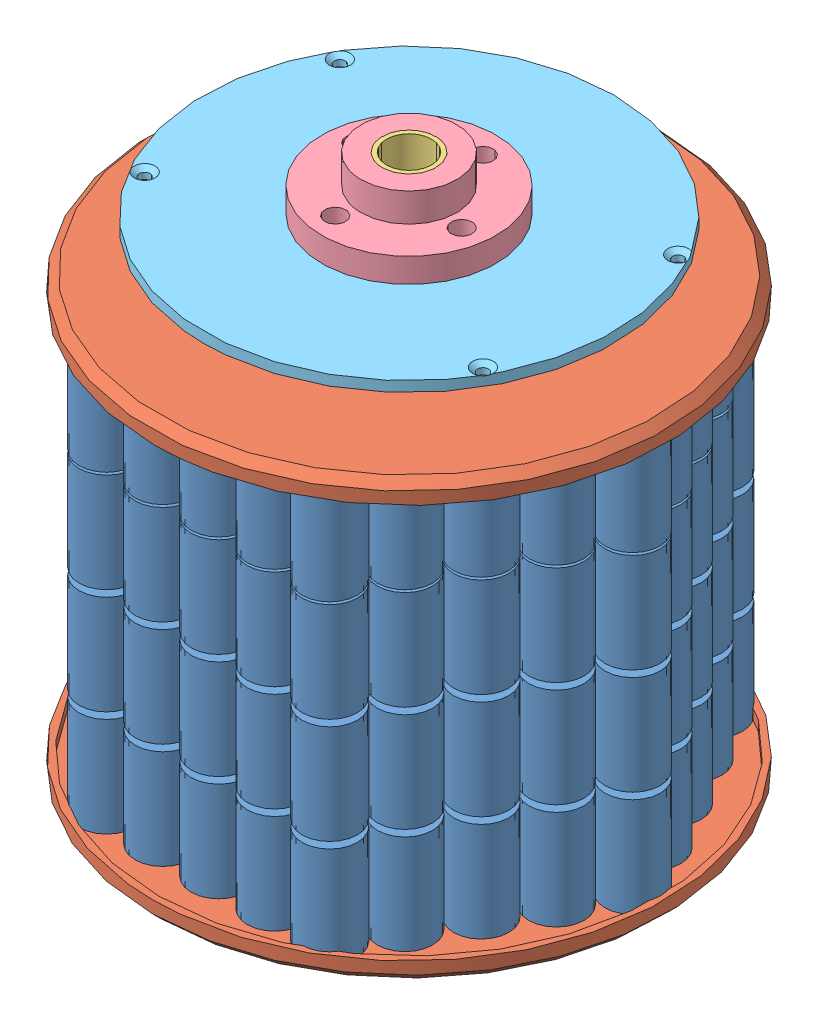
SolidWorks assembly Rover MX1300 battery pack.SLDASM, configuration Default (file format 3100). Lengths in mm.
Overall size (371.76 367.27 378.24).
323 component instances, 6 part files, 26 mates.
Components (placement in the parent):
- MX1300 60 pack-1: MX1300 60 pack.SLDASM [Default] at origin size (352.05 63 346.25)
  - MX1300 20 pack-1: MX1300 20 pack.SLDASM [Default] at (151.7205 0 -357.6328) x (0.5 0 -0.866025) z (0.866025 0 0.5) size (208.75 63 152.66)
    - MX1300 4 pack-1: MX1300 4 pack.sldasm [Default] at (-237.9849 0 135.8963) size (138.32 63 34.2)
      - Duracell MX1300 Alk-1: Duracell MX1300 Alk.sldprt [Default] at (13.6671 0 17.1) size (34.2 63 34.2)
      - Duracell MX1300 Alk-2: Duracell MX1300 Alk.sldprt [Default] at (-21.0409 0 17.1) size (34.2 63 34.2)
      - Duracell MX1300 Alk-3: Duracell MX1300 Alk.sldprt [Default] at (-55.7489 0 17.1) size (34.2 63 34.2)
      - Duracell MX1300 Alk-4: Duracell MX1300 Alk.sldprt [Default] at (-90.4569 0 17.1) size (34.2 63 34.2)
    - MX1300 4 pack-2: MX1300 4 pack.sldasm [Default] at (-255.8432 0 106.1351) size (138.32 63 34.2)
      - Duracell MX1300 Alk-1: Duracell MX1300 Alk.sldprt [Default] at (13.6671 0 17.1) size (34.2 63 34.2)
      - Duracell MX1300 Alk-2: Duracell MX1300 Alk.sldprt [Default] at (-21.0409 0 17.1) size (34.2 63 34.2)
      - Duracell MX1300 Alk-3: Duracell MX1300 Alk.sldprt [Default] at (-55.7489 0 17.1) size (34.2 63 34.2)
      - Duracell MX1300 Alk-4: Duracell MX1300 Alk.sldprt [Default] at (-90.4569 0 17.1) size (34.2 63 34.2)
    - MX1300 4 pack-3: MX1300 4 pack.sldasm [Default] at (-273.1972 0 76.6652) size (138.32 63 34.2)
      - Duracell MX1300 Alk-1: Duracell MX1300 Alk.sldprt [Default] at (13.6671 0 17.1) size (34.2 63 34.2)
      - Duracell MX1300 Alk-2: Duracell MX1300 Alk.sldprt [Default] at (-21.0409 0 17.1) size (34.2 63 34.2)
      - Duracell MX1300 Alk-3: Duracell MX1300 Alk.sldprt [Default] at (-55.7489 0 17.1) size (34.2 63 34.2)
      - Duracell MX1300 Alk-4: Duracell MX1300 Alk.sldprt [Default] at (-90.4569 0 17.1) size (34.2 63 34.2)
    - MX1300 4 pack-4: MX1300 4 pack.sldasm [Default] at (-291.0555 0 46.904) size (138.32 63 34.2)
      - Duracell MX1300 Alk-1: Duracell MX1300 Alk.sldprt [Default] at (13.6671 0 17.1) size (34.2 63 34.2)
      - Duracell MX1300 Alk-2: Duracell MX1300 Alk.sldprt [Default] at (-21.0409 0 17.1) size (34.2 63 34.2)
      - Duracell MX1300 Alk-3: Duracell MX1300 Alk.sldprt [Default] at (-55.7489 0 17.1) size (34.2 63 34.2)
      - Duracell MX1300 Alk-4: Duracell MX1300 Alk.sldprt [Default] at (-90.4569 0 17.1) size (34.2 63 34.2)
    - MX1300 4 pack-5: MX1300 4 pack.sldasm [Default] at (-308.4095 0 17.434) size (138.32 63 34.2)
      - Duracell MX1300 Alk-1: Duracell MX1300 Alk.sldprt [Default] at (13.6671 0 17.1) size (34.2 63 34.2)
      - Duracell MX1300 Alk-2: Duracell MX1300 Alk.sldprt [Default] at (-21.0409 0 17.1) size (34.2 63 34.2)
      - Duracell MX1300 Alk-3: Duracell MX1300 Alk.sldprt [Default] at (-55.7489 0 17.1) size (34.2 63 34.2)
      - Duracell MX1300 Alk-4: Duracell MX1300 Alk.sldprt [Default] at (-90.4569 0 17.1) size (34.2 63 34.2)
  - MX1300 20 pack-2: MX1300 20 pack.SLDASM [Default] at (-55.4976 0 -174.7254) x (-0.5 0 -0.866025) z (0.866025 0 -0.5) size (208.75 63 152.66)
    - MX1300 4 pack-1: MX1300 4 pack.sldasm [Default] at (-237.9849 0 135.8963) size (138.32 63 34.2)
      - Duracell MX1300 Alk-1: Duracell MX1300 Alk.sldprt [Default] at (13.6671 0 17.1) size (34.2 63 34.2)
      - Duracell MX1300 Alk-2: Duracell MX1300 Alk.sldprt [Default] at (-21.0409 0 17.1) size (34.2 63 34.2)
      - Duracell MX1300 Alk-3: Duracell MX1300 Alk.sldprt [Default] at (-55.7489 0 17.1) size (34.2 63 34.2)
      - Duracell MX1300 Alk-4: Duracell MX1300 Alk.sldprt [Default] at (-90.4569 0 17.1) size (34.2 63 34.2)
    - MX1300 4 pack-2: MX1300 4 pack.sldasm [Default] at (-255.8432 0 106.1351) size (138.32 63 34.2)
      - Duracell MX1300 Alk-1: Duracell MX1300 Alk.sldprt [Default] at (13.6671 0 17.1) size (34.2 63 34.2)
      - Duracell MX1300 Alk-2: Duracell MX1300 Alk.sldprt [Default] at (-21.0409 0 17.1) size (34.2 63 34.2)
      - Duracell MX1300 Alk-3: Duracell MX1300 Alk.sldprt [Default] at (-55.7489 0 17.1) size (34.2 63 34.2)
      - Duracell MX1300 Alk-4: Duracell MX1300 Alk.sldprt [Default] at (-90.4569 0 17.1) size (34.2 63 34.2)
    - MX1300 4 pack-3: MX1300 4 pack.sldasm [Default] at (-273.1972 0 76.6652) size (138.32 63 34.2)
      - Duracell MX1300 Alk-1: Duracell MX1300 Alk.sldprt [Default] at (13.6671 0 17.1) size (34.2 63 34.2)
      - Duracell MX1300 Alk-2: Duracell MX1300 Alk.sldprt [Default] at (-21.0409 0 17.1) size (34.2 63 34.2)
      - Duracell MX1300 Alk-3: Duracell MX1300 Alk.sldprt [Default] at (-55.7489 0 17.1) size (34.2 63 34.2)
      - Duracell MX1300 Alk-4: Duracell MX1300 Alk.sldprt [Default] at (-90.4569 0 17.1) size (34.2 63 34.2)
    - MX1300 4 pack-4: MX1300 4 pack.sldasm [Default] at (-291.0555 0 46.904) size (138.32 63 34.2)
      - Duracell MX1300 Alk-1: Duracell MX1300 Alk.sldprt [Default] at (13.6671 0 17.1) size (34.2 63 34.2)
      - Duracell MX1300 Alk-2: Duracell MX1300 Alk.sldprt [Default] at (-21.0409 0 17.1) size (34.2 63 34.2)
      - Duracell MX1300 Alk-3: Duracell MX1300 Alk.sldprt [Default] at (-55.7489 0 17.1) size (34.2 63 34.2)
      - Duracell MX1300 Alk-4: Duracell MX1300 Alk.sldprt [Default] at (-90.4569 0 17.1) size (34.2 63 34.2)
    - MX1300 4 pack-5: MX1300 4 pack.sldasm [Default] at (-308.4095 0 17.434) size (138.32 63 34.2)
      - Duracell MX1300 Alk-1: Duracell MX1300 Alk.sldprt [Default] at (13.6671 0 17.1) size (34.2 63 34.2)
      - Duracell MX1300 Alk-2: Duracell MX1300 Alk.sldprt [Default] at (-21.0409 0 17.1) size (34.2 63 34.2)
      - Duracell MX1300 Alk-3: Duracell MX1300 Alk.sldprt [Default] at (-55.7489 0 17.1) size (34.2 63 34.2)
      - Duracell MX1300 Alk-4: Duracell MX1300 Alk.sldprt [Default] at (-90.4569 0 17.1) size (34.2 63 34.2)
  - MX1300 20 pack-3: MX1300 20 pack.SLDASM [Default] at (363.7095 0 0) size (208.75 63 152.66)
    - MX1300 4 pack-1: MX1300 4 pack.sldasm [Default] at (-237.9849 0 135.8963) size (138.32 63 34.2)
      - Duracell MX1300 Alk-1: Duracell MX1300 Alk.sldprt [Default] at (13.6671 0 17.1) size (34.2 63 34.2)
      - Duracell MX1300 Alk-2: Duracell MX1300 Alk.sldprt [Default] at (-21.0409 0 17.1) size (34.2 63 34.2)
      - Duracell MX1300 Alk-3: Duracell MX1300 Alk.sldprt [Default] at (-55.7489 0 17.1) size (34.2 63 34.2)
      - Duracell MX1300 Alk-4: Duracell MX1300 Alk.sldprt [Default] at (-90.4569 0 17.1) size (34.2 63 34.2)
    - MX1300 4 pack-2: MX1300 4 pack.sldasm [Default] at (-255.8432 0 106.1351) size (138.32 63 34.2)
      - Duracell MX1300 Alk-1: Duracell MX1300 Alk.sldprt [Default] at (13.6671 0 17.1) size (34.2 63 34.2)
      - Duracell MX1300 Alk-2: Duracell MX1300 Alk.sldprt [Default] at (-21.0409 0 17.1) size (34.2 63 34.2)
      - Duracell MX1300 Alk-3: Duracell MX1300 Alk.sldprt [Default] at (-55.7489 0 17.1) size (34.2 63 34.2)
      - Duracell MX1300 Alk-4: Duracell MX1300 Alk.sldprt [Default] at (-90.4569 0 17.1) size (34.2 63 34.2)
    - MX1300 4 pack-3: MX1300 4 pack.sldasm [Default] at (-273.1972 0 76.6652) size (138.32 63 34.2)
      - Duracell MX1300 Alk-1: Duracell MX1300 Alk.sldprt [Default] at (13.6671 0 17.1) size (34.2 63 34.2)
      - Duracell MX1300 Alk-2: Duracell MX1300 Alk.sldprt [Default] at (-21.0409 0 17.1) size (34.2 63 34.2)
      - Duracell MX1300 Alk-3: Duracell MX1300 Alk.sldprt [Default] at (-55.7489 0 17.1) size (34.2 63 34.2)
      - Duracell MX1300 Alk-4: Duracell MX1300 Alk.sldprt [Default] at (-90.4569 0 17.1) size (34.2 63 34.2)
    - MX1300 4 pack-4: MX1300 4 pack.sldasm [Default] at (-291.0555 0 46.904) size (138.32 63 34.2)
      - Duracell MX1300 Alk-1: Duracell MX1300 Alk.sldprt [Default] at (13.6671 0 17.1) size (34.2 63 34.2)
      - Duracell MX1300 Alk-2: Duracell MX1300 Alk.sldprt [Default] at (-21.0409 0 17.1) size (34.2 63 34.2)
      - Duracell MX1300 Alk-3: Duracell MX1300 Alk.sldprt [Default] at (-55.7489 0 17.1) size (34.2 63 34.2)
      - Duracell MX1300 Alk-4: Duracell MX1300 Alk.sldprt [Default] at (-90.4569 0 17.1) size (34.2 63 34.2)
    - MX1300 4 pack-5: MX1300 4 pack.sldasm [Default] at (-308.4095 0 17.434) size (138.32 63 34.2)
      - Duracell MX1300 Alk-1: Duracell MX1300 Alk.sldprt [Default] at (13.6671 0 17.1) size (34.2 63 34.2)
      - Duracell MX1300 Alk-2: Duracell MX1300 Alk.sldprt [Default] at (-21.0409 0 17.1) size (34.2 63 34.2)
      - Duracell MX1300 Alk-3: Duracell MX1300 Alk.sldprt [Default] at (-55.7489 0 17.1) size (34.2 63 34.2)
      - Duracell MX1300 Alk-4: Duracell MX1300 Alk.sldprt [Default] at (-90.4569 0 17.1) size (34.2 63 34.2)
- MX1300 60 pack-2: MX1300 60 pack.SLDASM [Default] at (0 131.08 0) size (352.05 63 346.25)
  - MX1300 20 pack-1: MX1300 20 pack.SLDASM [Default] at (151.7205 0 -357.6328) x (0.5 0 -0.866025) z (0.866025 0 0.5) size (208.75 63 152.66)
    - MX1300 4 pack-1: MX1300 4 pack.sldasm [Default] at (-237.9849 0 135.8963) size (138.32 63 34.2)
      - Duracell MX1300 Alk-1: Duracell MX1300 Alk.sldprt [Default] at (13.6671 0 17.1) size (34.2 63 34.2)
      - Duracell MX1300 Alk-2: Duracell MX1300 Alk.sldprt [Default] at (-21.0409 0 17.1) size (34.2 63 34.2)
      - Duracell MX1300 Alk-3: Duracell MX1300 Alk.sldprt [Default] at (-55.7489 0 17.1) size (34.2 63 34.2)
      - Duracell MX1300 Alk-4: Duracell MX1300 Alk.sldprt [Default] at (-90.4569 0 17.1) size (34.2 63 34.2)
    - MX1300 4 pack-2: MX1300 4 pack.sldasm [Default] at (-255.8432 0 106.1351) size (138.32 63 34.2)
      - Duracell MX1300 Alk-1: Duracell MX1300 Alk.sldprt [Default] at (13.6671 0 17.1) size (34.2 63 34.2)
      - Duracell MX1300 Alk-2: Duracell MX1300 Alk.sldprt [Default] at (-21.0409 0 17.1) size (34.2 63 34.2)
      - Duracell MX1300 Alk-3: Duracell MX1300 Alk.sldprt [Default] at (-55.7489 0 17.1) size (34.2 63 34.2)
      - Duracell MX1300 Alk-4: Duracell MX1300 Alk.sldprt [Default] at (-90.4569 0 17.1) size (34.2 63 34.2)
    - MX1300 4 pack-3: MX1300 4 pack.sldasm [Default] at (-273.1972 0 76.6652) size (138.32 63 34.2)
      - Duracell MX1300 Alk-1: Duracell MX1300 Alk.sldprt [Default] at (13.6671 0 17.1) size (34.2 63 34.2)
      - Duracell MX1300 Alk-2: Duracell MX1300 Alk.sldprt [Default] at (-21.0409 0 17.1) size (34.2 63 34.2)
      - Duracell MX1300 Alk-3: Duracell MX1300 Alk.sldprt [Default] at (-55.7489 0 17.1) size (34.2 63 34.2)
      - Duracell MX1300 Alk-4: Duracell MX1300 Alk.sldprt [Default] at (-90.4569 0 17.1) size (34.2 63 34.2)
    - MX1300 4 pack-4: MX1300 4 pack.sldasm [Default] at (-291.0555 0 46.904) size (138.32 63 34.2)
      - Duracell MX1300 Alk-1: Duracell MX1300 Alk.sldprt [Default] at (13.6671 0 17.1) size (34.2 63 34.2)
      - Duracell MX1300 Alk-2: Duracell MX1300 Alk.sldprt [Default] at (-21.0409 0 17.1) size (34.2 63 34.2)
      - Duracell MX1300 Alk-3: Duracell MX1300 Alk.sldprt [Default] at (-55.7489 0 17.1) size (34.2 63 34.2)
      - Duracell MX1300 Alk-4: Duracell MX1300 Alk.sldprt [Default] at (-90.4569 0 17.1) size (34.2 63 34.2)
    - MX1300 4 pack-5: MX1300 4 pack.sldasm [Default] at (-308.4095 0 17.434) size (138.32 63 34.2)
      - Duracell MX1300 Alk-1: Duracell MX1300 Alk.sldprt [Default] at (13.6671 0 17.1) size (34.2 63 34.2)
      - Duracell MX1300 Alk-2: Duracell MX1300 Alk.sldprt [Default] at (-21.0409 0 17.1) size (34.2 63 34.2)
      - Duracell MX1300 Alk-3: Duracell MX1300 Alk.sldprt [Default] at (-55.7489 0 17.1) size (34.2 63 34.2)
      - Duracell MX1300 Alk-4: Duracell MX1300 Alk.sldprt [Default] at (-90.4569 0 17.1) size (34.2 63 34.2)
  - MX1300 20 pack-2: MX1300 20 pack.SLDASM [Default] at (-55.4976 0 -174.7254) x (-0.5 0 -0.866025) z (0.866025 0 -0.5) size (208.75 63 152.66)
    - MX1300 4 pack-1: MX1300 4 pack.sldasm [Default] at (-237.9849 0 135.8963) size (138.32 63 34.2)
      - Duracell MX1300 Alk-1: Duracell MX1300 Alk.sldprt [Default] at (13.6671 0 17.1) size (34.2 63 34.2)
      - Duracell MX1300 Alk-2: Duracell MX1300 Alk.sldprt [Default] at (-21.0409 0 17.1) size (34.2 63 34.2)
      - Duracell MX1300 Alk-3: Duracell MX1300 Alk.sldprt [Default] at (-55.7489 0 17.1) size (34.2 63 34.2)
      - Duracell MX1300 Alk-4: Duracell MX1300 Alk.sldprt [Default] at (-90.4569 0 17.1) size (34.2 63 34.2)
    - MX1300 4 pack-2: MX1300 4 pack.sldasm [Default] at (-255.8432 0 106.1351) size (138.32 63 34.2)
      - Duracell MX1300 Alk-1: Duracell MX1300 Alk.sldprt [Default] at (13.6671 0 17.1) size (34.2 63 34.2)
      - Duracell MX1300 Alk-2: Duracell MX1300 Alk.sldprt [Default] at (-21.0409 0 17.1) size (34.2 63 34.2)
      - Duracell MX1300 Alk-3: Duracell MX1300 Alk.sldprt [Default] at (-55.7489 0 17.1) size (34.2 63 34.2)
      - Duracell MX1300 Alk-4: Duracell MX1300 Alk.sldprt [Default] at (-90.4569 0 17.1) size (34.2 63 34.2)
    - MX1300 4 pack-3: MX1300 4 pack.sldasm [Default] at (-273.1972 0 76.6652) size (138.32 63 34.2)
      - Duracell MX1300 Alk-1: Duracell MX1300 Alk.sldprt [Default] at (13.6671 0 17.1) size (34.2 63 34.2)
      - Duracell MX1300 Alk-2: Duracell MX1300 Alk.sldprt [Default] at (-21.0409 0 17.1) size (34.2 63 34.2)
      - Duracell MX1300 Alk-3: Duracell MX1300 Alk.sldprt [Default] at (-55.7489 0 17.1) size (34.2 63 34.2)
      - Duracell MX1300 Alk-4: Duracell MX1300 Alk.sldprt [Default] at (-90.4569 0 17.1) size (34.2 63 34.2)
    - MX1300 4 pack-4: MX1300 4 pack.sldasm [Default] at (-291.0555 0 46.904) size (138.32 63 34.2)
      - Duracell MX1300 Alk-1: Duracell MX1300 Alk.sldprt [Default] at (13.6671 0 17.1) size (34.2 63 34.2)
      - Duracell MX1300 Alk-2: Duracell MX1300 Alk.sldprt [Default] at (-21.0409 0 17.1) size (34.2 63 34.2)
      - Duracell MX1300 Alk-3: Duracell MX1300 Alk.sldprt [Default] at (-55.7489 0 17.1) size (34.2 63 34.2)
      - Duracell MX1300 Alk-4: Duracell MX1300 Alk.sldprt [Default] at (-90.4569 0 17.1) size (34.2 63 34.2)
    - MX1300 4 pack-5: MX1300 4 pack.sldasm [Default] at (-308.4095 0 17.434) size (138.32 63 34.2)
      - Duracell MX1300 Alk-1: Duracell MX1300 Alk.sldprt [Default] at (13.6671 0 17.1) size (34.2 63 34.2)
      - Duracell MX1300 Alk-2: Duracell MX1300 Alk.sldprt [Default] at (-21.0409 0 17.1) size (34.2 63 34.2)
      - Duracell MX1300 Alk-3: Duracell MX1300 Alk.sldprt [Default] at (-55.7489 0 17.1) size (34.2 63 34.2)
      - Duracell MX1300 Alk-4: Duracell MX1300 Alk.sldprt [Default] at (-90.4569 0 17.1) size (34.2 63 34.2)
  - MX1300 20 pack-3: MX1300 20 pack.SLDASM [Default] at (363.7095 0 0) size (208.75 63 152.66)
    - MX1300 4 pack-1: MX1300 4 pack.sldasm [Default] at (-237.9849 0 135.8963) size (138.32 63 34.2)
      - Duracell MX1300 Alk-1: Duracell MX1300 Alk.sldprt [Default] at (13.6671 0 17.1) size (34.2 63 34.2)
      - Duracell MX1300 Alk-2: Duracell MX1300 Alk.sldprt [Default] at (-21.0409 0 17.1) size (34.2 63 34.2)
      - Duracell MX1300 Alk-3: Duracell MX1300 Alk.sldprt [Default] at (-55.7489 0 17.1) size (34.2 63 34.2)
      - Duracell MX1300 Alk-4: Duracell MX1300 Alk.sldprt [Default] at (-90.4569 0 17.1) size (34.2 63 34.2)
    - MX1300 4 pack-2: MX1300 4 pack.sldasm [Default] at (-255.8432 0 106.1351) size (138.32 63 34.2)
      - Duracell MX1300 Alk-1: Duracell MX1300 Alk.sldprt [Default] at (13.6671 0 17.1) size (34.2 63 34.2)
      - Duracell MX1300 Alk-2: Duracell MX1300 Alk.sldprt [Default] at (-21.0409 0 17.1) size (34.2 63 34.2)
      - Duracell MX1300 Alk-3: Duracell MX1300 Alk.sldprt [Default] at (-55.7489 0 17.1) size (34.2 63 34.2)
      - Duracell MX1300 Alk-4: Duracell MX1300 Alk.sldprt [Default] at (-90.4569 0 17.1) size (34.2 63 34.2)
    - MX1300 4 pack-3: MX1300 4 pack.sldasm [Default] at (-273.1972 0 76.6652) size (138.32 63 34.2)
      - Duracell MX1300 Alk-1: Duracell MX1300 Alk.sldprt [Default] at (13.6671 0 17.1) size (34.2 63 34.2)
      - Duracell MX1300 Alk-2: Duracell MX1300 Alk.sldprt [Default] at (-21.0409 0 17.1) size (34.2 63 34.2)
      - Duracell MX1300 Alk-3: Duracell MX1300 Alk.sldprt [Default] at (-55.7489 0 17.1) size (34.2 63 34.2)
      - Duracell MX1300 Alk-4: Duracell MX1300 Alk.sldprt [Default] at (-90.4569 0 17.1) size (34.2 63 34.2)
    - MX1300 4 pack-4: MX1300 4 pack.sldasm [Default] at (-291.0555 0 46.904) size (138.32 63 34.2)
      - Duracell MX1300 Alk-1: Duracell MX1300 Alk.sldprt [Default] at (13.6671 0 17.1) size (34.2 63 34.2)
      - Duracell MX1300 Alk-2: Duracell MX1300 Alk.sldprt [Default] at (-21.0409 0 17.1) size (34.2 63 34.2)
      - Duracell MX1300 Alk-3: Duracell MX1300 Alk.sldprt [Default] at (-55.7489 0 17.1) size (34.2 63 34.2)
      - Duracell MX1300 Alk-4: Duracell MX1300 Alk.sldprt [Default] at (-90.4569 0 17.1) size (34.2 63 34.2)
    - MX1300 4 pack-5: MX1300 4 pack.sldasm [Default] at (-308.4095 0 17.434) size (138.32 63 34.2)
      - Duracell MX1300 Alk-1: Duracell MX1300 Alk.sldprt [Default] at (13.6671 0 17.1) size (34.2 63 34.2)
      - Duracell MX1300 Alk-2: Duracell MX1300 Alk.sldprt [Default] at (-21.0409 0 17.1) size (34.2 63 34.2)
      - Duracell MX1300 Alk-3: Duracell MX1300 Alk.sldprt [Default] at (-55.7489 0 17.1) size (34.2 63 34.2)
      - Duracell MX1300 Alk-4: Duracell MX1300 Alk.sldprt [Default] at (-90.4569 0 17.1) size (34.2 63 34.2)
- MX1300 60 pack-3: MX1300 60 pack.SLDASM [Default] at (0 65.54 0) size (352.05 63 346.25)
  - MX1300 20 pack-1: MX1300 20 pack.SLDASM [Default] at (151.7205 0 -357.6328) x (0.5 0 -0.866025) z (0.866025 0 0.5) size (208.75 63 152.66)
    - MX1300 4 pack-1: MX1300 4 pack.sldasm [Default] at (-237.9849 0 135.8963) size (138.32 63 34.2)
      - Duracell MX1300 Alk-1: Duracell MX1300 Alk.sldprt [Default] at (13.6671 0 17.1) size (34.2 63 34.2)
      - Duracell MX1300 Alk-2: Duracell MX1300 Alk.sldprt [Default] at (-21.0409 0 17.1) size (34.2 63 34.2)
      - Duracell MX1300 Alk-3: Duracell MX1300 Alk.sldprt [Default] at (-55.7489 0 17.1) size (34.2 63 34.2)
      - Duracell MX1300 Alk-4: Duracell MX1300 Alk.sldprt [Default] at (-90.4569 0 17.1) size (34.2 63 34.2)
    - MX1300 4 pack-2: MX1300 4 pack.sldasm [Default] at (-255.8432 0 106.1351) size (138.32 63 34.2)
      - Duracell MX1300 Alk-1: Duracell MX1300 Alk.sldprt [Default] at (13.6671 0 17.1) size (34.2 63 34.2)
      - Duracell MX1300 Alk-2: Duracell MX1300 Alk.sldprt [Default] at (-21.0409 0 17.1) size (34.2 63 34.2)
      - Duracell MX1300 Alk-3: Duracell MX1300 Alk.sldprt [Default] at (-55.7489 0 17.1) size (34.2 63 34.2)
      - Duracell MX1300 Alk-4: Duracell MX1300 Alk.sldprt [Default] at (-90.4569 0 17.1) size (34.2 63 34.2)
    - MX1300 4 pack-3: MX1300 4 pack.sldasm [Default] at (-273.1972 0 76.6652) size (138.32 63 34.2)
      - Duracell MX1300 Alk-1: Duracell MX1300 Alk.sldprt [Default] at (13.6671 0 17.1) size (34.2 63 34.2)
      - Duracell MX1300 Alk-2: Duracell MX1300 Alk.sldprt [Default] at (-21.0409 0 17.1) size (34.2 63 34.2)
      - Duracell MX1300 Alk-3: Duracell MX1300 Alk.sldprt [Default] at (-55.7489 0 17.1) size (34.2 63 34.2)
      - Duracell MX1300 Alk-4: Duracell MX1300 Alk.sldprt [Default] at (-90.4569 0 17.1) size (34.2 63 34.2)
    - MX1300 4 pack-4: MX1300 4 pack.sldasm [Default] at (-291.0555 0 46.904) size (138.32 63 34.2)
      - Duracell MX1300 Alk-1: Duracell MX1300 Alk.sldprt [Default] at (13.6671 0 17.1) size (34.2 63 34.2)
      - Duracell MX1300 Alk-2: Duracell MX1300 Alk.sldprt [Default] at (-21.0409 0 17.1) size (34.2 63 34.2)
      - Duracell MX1300 Alk-3: Duracell MX1300 Alk.sldprt [Default] at (-55.7489 0 17.1) size (34.2 63 34.2)
      - Duracell MX1300 Alk-4: Duracell MX1300 Alk.sldprt [Default] at (-90.4569 0 17.1) size (34.2 63 34.2)
    - MX1300 4 pack-5: MX1300 4 pack.sldasm [Default] at (-308.4095 0 17.434) size (138.32 63 34.2)
      - Duracell MX1300 Alk-1: Duracell MX1300 Alk.sldprt [Default] at (13.6671 0 17.1) size (34.2 63 34.2)
      - Duracell MX1300 Alk-2: Duracell MX1300 Alk.sldprt [Default] at (-21.0409 0 17.1) size (34.2 63 34.2)
      - Duracell MX1300 Alk-3: Duracell MX1300 Alk.sldprt [Default] at (-55.7489 0 17.1) size (34.2 63 34.2)
      - Duracell MX1300 Alk-4: Duracell MX1300 Alk.sldprt [Default] at (-90.4569 0 17.1) size (34.2 63 34.2)
  - MX1300 20 pack-2: MX1300 20 pack.SLDASM [Default] at (-55.4976 0 -174.7254) x (-0.5 0 -0.866025) z (0.866025 0 -0.5) size (208.75 63 152.66)
    - MX1300 4 pack-1: MX1300 4 pack.sldasm [Default] at (-237.9849 0 135.8963) size (138.32 63 34.2)
      - Duracell MX1300 Alk-1: Duracell MX1300 Alk.sldprt [Default] at (13.6671 0 17.1) size (34.2 63 34.2)
      - Duracell MX1300 Alk-2: Duracell MX1300 Alk.sldprt [Default] at (-21.0409 0 17.1) size (34.2 63 34.2)
      - Duracell MX1300 Alk-3: Duracell MX1300 Alk.sldprt [Default] at (-55.7489 0 17.1) size (34.2 63 34.2)
      - Duracell MX1300 Alk-4: Duracell MX1300 Alk.sldprt [Default] at (-90.4569 0 17.1) size (34.2 63 34.2)
    - MX1300 4 pack-2: MX1300 4 pack.sldasm [Default] at (-255.8432 0 106.1351) size (138.32 63 34.2)
      - Duracell MX1300 Alk-1: Duracell MX1300 Alk.sldprt [Default] at (13.6671 0 17.1) size (34.2 63 34.2)
      - Duracell MX1300 Alk-2: Duracell MX1300 Alk.sldprt [Default] at (-21.0409 0 17.1) size (34.2 63 34.2)
      - Duracell MX1300 Alk-3: Duracell MX1300 Alk.sldprt [Default] at (-55.7489 0 17.1) size (34.2 63 34.2)
      - Duracell MX1300 Alk-4: Duracell MX1300 Alk.sldprt [Default] at (-90.4569 0 17.1) size (34.2 63 34.2)
    - MX1300 4 pack-3: MX1300 4 pack.sldasm [Default] at (-273.1972 0 76.6652) size (138.32 63 34.2)
      - Duracell MX1300 Alk-1: Duracell MX1300 Alk.sldprt [Default] at (13.6671 0 17.1) size (34.2 63 34.2)
      - Duracell MX1300 Alk-2: Duracell MX1300 Alk.sldprt [Default] at (-21.0409 0 17.1) size (34.2 63 34.2)
      - Duracell MX1300 Alk-3: Duracell MX1300 Alk.sldprt [Default] at (-55.7489 0 17.1) size (34.2 63 34.2)
      - Duracell MX1300 Alk-4: Duracell MX1300 Alk.sldprt [Default] at (-90.4569 0 17.1) size (34.2 63 34.2)
    - MX1300 4 pack-4: MX1300 4 pack.sldasm [Default] at (-291.0555 0 46.904) size (138.32 63 34.2)
      - Duracell MX1300 Alk-1: Duracell MX1300 Alk.sldprt [Default] at (13.6671 0 17.1) size (34.2 63 34.2)
      - Duracell MX1300 Alk-2: Duracell MX1300 Alk.sldprt [Default] at (-21.0409 0 17.1) size (34.2 63 34.2)
      - Duracell MX1300 Alk-3: Duracell MX1300 Alk.sldprt [Default] at (-55.7489 0 17.1) size (34.2 63 34.2)
      - Duracell MX1300 Alk-4: Duracell MX1300 Alk.sldprt [Default] at (-90.4569 0 17.1) size (34.2 63 34.2)
    - MX1300 4 pack-5: MX1300 4 pack.sldasm [Default] at (-308.4095 0 17.434) size (138.32 63 34.2)
      - Duracell MX1300 Alk-1: Duracell MX1300 Alk.sldprt [Default] at (13.6671 0 17.1) size (34.2 63 34.2)
      - Duracell MX1300 Alk-2: Duracell MX1300 Alk.sldprt [Default] at (-21.0409 0 17.1) size (34.2 63 34.2)
      - Duracell MX1300 Alk-3: Duracell MX1300 Alk.sldprt [Default] at (-55.7489 0 17.1) size (34.2 63 34.2)
      - Duracell MX1300 Alk-4: Duracell MX1300 Alk.sldprt [Default] at (-90.4569 0 17.1) size (34.2 63 34.2)
  - MX1300 20 pack-3: MX1300 20 pack.SLDASM [Default] at (363.7095 0 0) size (208.75 63 152.66)
    - MX1300 4 pack-1: MX1300 4 pack.sldasm [Default] at (-237.9849 0 135.8963) size (138.32 63 34.2)
      - Duracell MX1300 Alk-1: Duracell MX1300 Alk.sldprt [Default] at (13.6671 0 17.1) size (34.2 63 34.2)
      - Duracell MX1300 Alk-2: Duracell MX1300 Alk.sldprt [Default] at (-21.0409 0 17.1) size (34.2 63 34.2)
      - Duracell MX1300 Alk-3: Duracell MX1300 Alk.sldprt [Default] at (-55.7489 0 17.1) size (34.2 63 34.2)
      - Duracell MX1300 Alk-4: Duracell MX1300 Alk.sldprt [Default] at (-90.4569 0 17.1) size (34.2 63 34.2)
    - MX1300 4 pack-2: MX1300 4 pack.sldasm [Default] at (-255.8432 0 106.1351) size (138.32 63 34.2)
      - Duracell MX1300 Alk-1: Duracell MX1300 Alk.sldprt [Default] at (13.6671 0 17.1) size (34.2 63 34.2)
      - Duracell MX1300 Alk-2: Duracell MX1300 Alk.sldprt [Default] at (-21.0409 0 17.1) size (34.2 63 34.2)
      - Duracell MX1300 Alk-3: Duracell MX1300 Alk.sldprt [Default] at (-55.7489 0 17.1) size (34.2 63 34.2)
      - Duracell MX1300 Alk-4: Duracell MX1300 Alk.sldprt [Default] at (-90.4569 0 17.1) size (34.2 63 34.2)
    - MX1300 4 pack-3: MX1300 4 pack.sldasm [Default] at (-273.1972 0 76.6652) size (138.32 63 34.2)
      - Duracell MX1300 Alk-1: Duracell MX1300 Alk.sldprt [Default] at (13.6671 0 17.1) size (34.2 63 34.2)
      - Duracell MX1300 Alk-2: Duracell MX1300 Alk.sldprt [Default] at (-21.0409 0 17.1) size (34.2 63 34.2)
      - Duracell MX1300 Alk-3: Duracell MX1300 Alk.sldprt [Default] at (-55.7489 0 17.1) size (34.2 63 34.2)
      - Duracell MX1300 Alk-4: Duracell MX1300 Alk.sldprt [Default] at (-90.4569 0 17.1) size (34.2 63 34.2)
    - MX1300 4 pack-4: MX1300 4 pack.sldasm [Default] at (-291.0555 0 46.904) size (138.32 63 34.2)
      - Duracell MX1300 Alk-1: Duracell MX1300 Alk.sldprt [Default] at (13.6671 0 17.1) size (34.2 63 34.2)
      - Duracell MX1300 Alk-2: Duracell MX1300 Alk.sldprt [Default] at (-21.0409 0 17.1) size (34.2 63 34.2)
      - Duracell MX1300 Alk-3: Duracell MX1300 Alk.sldprt [Default] at (-55.7489 0 17.1) size (34.2 63 34.2)
      - Duracell MX1300 Alk-4: Duracell MX1300 Alk.sldprt [Default] at (-90.4569 0 17.1) size (34.2 63 34.2)
    - MX1300 4 pack-5: MX1300 4 pack.sldasm [Default] at (-308.4095 0 17.434) size (138.32 63 34.2)
      - Duracell MX1300 Alk-1: Duracell MX1300 Alk.sldprt [Default] at (13.6671 0 17.1) size (34.2 63 34.2)
      - Duracell MX1300 Alk-2: Duracell MX1300 Alk.sldprt [Default] at (-21.0409 0 17.1) size (34.2 63 34.2)
      - Duracell MX1300 Alk-3: Duracell MX1300 Alk.sldprt [Default] at (-55.7489 0 17.1) size (34.2 63 34.2)
      - Duracell MX1300 Alk-4: Duracell MX1300 Alk.sldprt [Default] at (-90.4569 0 17.1) size (34.2 63 34.2)
- battery pack cap-1: battery pack cap.sldprt [Default] at (103.1597 263.43 33.6541) x (-0.994028 0 0.109127) z (0.109127 0 0.994028) size (317.5 12.7 317.5)
- battery pack cap-2: battery pack cap.sldprt [Default] at (103.1597 -6.35 33.6541) size (317.5 12.7 317.5)
- MX1300 60 pack-4: MX1300 60 pack.SLDASM [Default] at (0 194.08 0) size (352.05 63 346.25)
  - MX1300 20 pack-1: MX1300 20 pack.SLDASM [Default] at (151.7205 0 -357.6328) x (0.5 0 -0.866025) z (0.866025 0 0.5) size (208.75 63 152.66)
    - MX1300 4 pack-1: MX1300 4 pack.sldasm [Default] at (-237.9849 0 135.8963) size (138.32 63 34.2)
      - Duracell MX1300 Alk-1: Duracell MX1300 Alk.sldprt [Default] at (13.6671 0 17.1) size (34.2 63 34.2)
      - Duracell MX1300 Alk-2: Duracell MX1300 Alk.sldprt [Default] at (-21.0409 0 17.1) size (34.2 63 34.2)
      - Duracell MX1300 Alk-3: Duracell MX1300 Alk.sldprt [Default] at (-55.7489 0 17.1) size (34.2 63 34.2)
      - Duracell MX1300 Alk-4: Duracell MX1300 Alk.sldprt [Default] at (-90.4569 0 17.1) size (34.2 63 34.2)
    - MX1300 4 pack-2: MX1300 4 pack.sldasm [Default] at (-255.8432 0 106.1351) size (138.32 63 34.2)
      - Duracell MX1300 Alk-1: Duracell MX1300 Alk.sldprt [Default] at (13.6671 0 17.1) size (34.2 63 34.2)
      - Duracell MX1300 Alk-2: Duracell MX1300 Alk.sldprt [Default] at (-21.0409 0 17.1) size (34.2 63 34.2)
      - Duracell MX1300 Alk-3: Duracell MX1300 Alk.sldprt [Default] at (-55.7489 0 17.1) size (34.2 63 34.2)
      - Duracell MX1300 Alk-4: Duracell MX1300 Alk.sldprt [Default] at (-90.4569 0 17.1) size (34.2 63 34.2)
    - MX1300 4 pack-3: MX1300 4 pack.sldasm [Default] at (-273.1972 0 76.6652) size (138.32 63 34.2)
      - Duracell MX1300 Alk-1: Duracell MX1300 Alk.sldprt [Default] at (13.6671 0 17.1) size (34.2 63 34.2)
      - Duracell MX1300 Alk-2: Duracell MX1300 Alk.sldprt [Default] at (-21.0409 0 17.1) size (34.2 63 34.2)
      - Duracell MX1300 Alk-3: Duracell MX1300 Alk.sldprt [Default] at (-55.7489 0 17.1) size (34.2 63 34.2)
      - Duracell MX1300 Alk-4: Duracell MX1300 Alk.sldprt [Default] at (-90.4569 0 17.1) size (34.2 63 34.2)
    - MX1300 4 pack-4: MX1300 4 pack.sldasm [Default] at (-291.0555 0 46.904) size (138.32 63 34.2)
      - Duracell MX1300 Alk-1: Duracell MX1300 Alk.sldprt [Default] at (13.6671 0 17.1) size (34.2 63 34.2)
      - Duracell MX1300 Alk-2: Duracell MX1300 Alk.sldprt [Default] at (-21.0409 0 17.1) size (34.2 63 34.2)
      - Duracell MX1300 Alk-3: Duracell MX1300 Alk.sldprt [Default] at (-55.7489 0 17.1) size (34.2 63 34.2)
      - Duracell MX1300 Alk-4: Duracell MX1300 Alk.sldprt [Default] at (-90.4569 0 17.1) size (34.2 63 34.2)
    - MX1300 4 pack-5: MX1300 4 pack.sldasm [Default] at (-308.4095 0 17.434) size (138.32 63 34.2)
      - Duracell MX1300 Alk-1: Duracell MX1300 Alk.sldprt [Default] at (13.6671 0 17.1) size (34.2 63 34.2)
      - Duracell MX1300 Alk-2: Duracell MX1300 Alk.sldprt [Default] at (-21.0409 0 17.1) size (34.2 63 34.2)
      - Duracell MX1300 Alk-3: Duracell MX1300 Alk.sldprt [Default] at (-55.7489 0 17.1) size (34.2 63 34.2)
      - Duracell MX1300 Alk-4: Duracell MX1300 Alk.sldprt [Default] at (-90.4569 0 17.1) size (34.2 63 34.2)
  - MX1300 20 pack-2: MX1300 20 pack.SLDASM [Default] at (-55.4976 0 -174.7254) x (-0.5 0 -0.866025) z (0.866025 0 -0.5) size (208.75 63 152.66)
    - MX1300 4 pack-1: MX1300 4 pack.sldasm [Default] at (-237.9849 0 135.8963) size (138.32 63 34.2)
      - Duracell MX1300 Alk-1: Duracell MX1300 Alk.sldprt [Default] at (13.6671 0 17.1) size (34.2 63 34.2)
      - Duracell MX1300 Alk-2: Duracell MX1300 Alk.sldprt [Default] at (-21.0409 0 17.1) size (34.2 63 34.2)
      - Duracell MX1300 Alk-3: Duracell MX1300 Alk.sldprt [Default] at (-55.7489 0 17.1) size (34.2 63 34.2)
      - Duracell MX1300 Alk-4: Duracell MX1300 Alk.sldprt [Default] at (-90.4569 0 17.1) size (34.2 63 34.2)
    - MX1300 4 pack-2: MX1300 4 pack.sldasm [Default] at (-255.8432 0 106.1351) size (138.32 63 34.2)
      - Duracell MX1300 Alk-1: Duracell MX1300 Alk.sldprt [Default] at (13.6671 0 17.1) size (34.2 63 34.2)
      - Duracell MX1300 Alk-2: Duracell MX1300 Alk.sldprt [Default] at (-21.0409 0 17.1) size (34.2 63 34.2)
      - Duracell MX1300 Alk-3: Duracell MX1300 Alk.sldprt [Default] at (-55.7489 0 17.1) size (34.2 63 34.2)
      - Duracell MX1300 Alk-4: Duracell MX1300 Alk.sldprt [Default] at (-90.4569 0 17.1) size (34.2 63 34.2)
    - MX1300 4 pack-3: MX1300 4 pack.sldasm [Default] at (-273.1972 0 76.6652) size (138.32 63 34.2)
      - Duracell MX1300 Alk-1: Duracell MX1300 Alk.sldprt [Default] at (13.6671 0 17.1) size (34.2 63 34.2)
      - Duracell MX1300 Alk-2: Duracell MX1300 Alk.sldprt [Default] at (-21.0409 0 17.1) size (34.2 63 34.2)
      - Duracell MX1300 Alk-3: Duracell MX1300 Alk.sldprt [Default] at (-55.7489 0 17.1) size (34.2 63 34.2)
      - Duracell MX1300 Alk-4: Duracell MX1300 Alk.sldprt [Default] at (-90.4569 0 17.1) size (34.2 63 34.2)
    - MX1300 4 pack-4: MX1300 4 pack.sldasm [Default] at (-291.0555 0 46.904) size (138.32 63 34.2)
      - Duracell MX1300 Alk-1: Duracell MX1300 Alk.sldprt [Default] at (13.6671 0 17.1) size (34.2 63 34.2)
      - Duracell MX1300 Alk-2: Duracell MX1300 Alk.sldprt [Default] at (-21.0409 0 17.1) size (34.2 63 34.2)
      - Duracell MX1300 Alk-3: Duracell MX1300 Alk.sldprt [Default] at (-55.7489 0 17.1) size (34.2 63 34.2)
      - Duracell MX1300 Alk-4: Duracell MX1300 Alk.sldprt [Default] at (-90.4569 0 17.1) size (34.2 63 34.2)
    - MX1300 4 pack-5: MX1300 4 pack.sldasm [Default] at (-308.4095 0 17.434) size (138.32 63 34.2)
      - Duracell MX1300 Alk-1: Duracell MX1300 Alk.sldprt [Default] at (13.6671 0 17.1) size (34.2 63 34.2)
      - Duracell MX1300 Alk-2: Duracell MX1300 Alk.sldprt [Default] at (-21.0409 0 17.1) size (34.2 63 34.2)
      - Duracell MX1300 Alk-3: Duracell MX1300 Alk.sldprt [Default] at (-55.7489 0 17.1) size (34.2 63 34.2)
      - Duracell MX1300 Alk-4: Duracell MX1300 Alk.sldprt [Default] at (-90.4569 0 17.1) size (34.2 63 34.2)
  - MX1300 20 pack-3: MX1300 20 pack.SLDASM [Default] at (363.7095 0 0) size (208.75 63 152.66)
    - MX1300 4 pack-1: MX1300 4 pack.sldasm [Default] at (-237.9849 0 135.8963) size (138.32 63 34.2)
      - Duracell MX1300 Alk-1: Duracell MX1300 Alk.sldprt [Default] at (13.6671 0 17.1) size (34.2 63 34.2)
      - Duracell MX1300 Alk-2: Duracell MX1300 Alk.sldprt [Default] at (-21.0409 0 17.1) size (34.2 63 34.2)
      - Duracell MX1300 Alk-3: Duracell MX1300 Alk.sldprt [Default] at (-55.7489 0 17.1) size (34.2 63 34.2)
      - Duracell MX1300 Alk-4: Duracell MX1300 Alk.sldprt [Default] at (-90.4569 0 17.1) size (34.2 63 34.2)
    - MX1300 4 pack-2: MX1300 4 pack.sldasm [Default] at (-255.8432 0 106.1351) size (138.32 63 34.2)
      - Duracell MX1300 Alk-1: Duracell MX1300 Alk.sldprt [Default] at (13.6671 0 17.1) size (34.2 63 34.2)
      - Duracell MX1300 Alk-2: Duracell MX1300 Alk.sldprt [Default] at (-21.0409 0 17.1) size (34.2 63 34.2)
      - Duracell MX1300 Alk-3: Duracell MX1300 Alk.sldprt [Default] at (-55.7489 0 17.1) size (34.2 63 34.2)
      - Duracell MX1300 Alk-4: Duracell MX1300 Alk.sldprt [Default] at (-90.4569 0 17.1) size (34.2 63 34.2)
    - MX1300 4 pack-3: MX1300 4 pack.sldasm [Default] at (-273.1972 0 76.6652) size (138.32 63 34.2)
      - Duracell MX1300 Alk-1: Duracell MX1300 Alk.sldprt [Default] at (13.6671 0 17.1) size (34.2 63 34.2)
      - Duracell MX1300 Alk-2: Duracell MX1300 Alk.sldprt [Default] at (-21.0409 0 17.1) size (34.2 63 34.2)
      - Duracell MX1300 Alk-3: Duracell MX1300 Alk.sldprt [Default] at (-55.7489 0 17.1) size (34.2 63 34.2)
      - Duracell MX1300 Alk-4: Duracell MX1300 Alk.sldprt [Default] at (-90.4569 0 17.1) size (34.2 63 34.2)
    - MX1300 4 pack-4: MX1300 4 pack.sldasm [Default] at (-291.0555 0 46.904) size (138.32 63 34.2)
      - Duracell MX1300 Alk-1: Duracell MX1300 Alk.sldprt [Default] at (13.6671 0 17.1) size (34.2 63 34.2)
      - Duracell MX1300 Alk-2: Duracell MX1300 Alk.sldprt [Default] at (-21.0409 0 17.1) size (34.2 63 34.2)
      - Duracell MX1300 Alk-3: Duracell MX1300 Alk.sldprt [Default] at (-55.7489 0 17.1) size (34.2 63 34.2)
      - Duracell MX1300 Alk-4: Duracell MX1300 Alk.sldprt [Default] at (-90.4569 0 17.1) size (34.2 63 34.2)
    - MX1300 4 pack-5: MX1300 4 pack.sldasm [Default] at (-308.4095 0 17.434) size (138.32 63 34.2)
      - Duracell MX1300 Alk-1: Duracell MX1300 Alk.sldprt [Default] at (13.6671 0 17.1) size (34.2 63 34.2)
      - Duracell MX1300 Alk-2: Duracell MX1300 Alk.sldprt [Default] at (-21.0409 0 17.1) size (34.2 63 34.2)
      - Duracell MX1300 Alk-3: Duracell MX1300 Alk.sldprt [Default] at (-55.7489 0 17.1) size (34.2 63 34.2)
      - Duracell MX1300 Alk-4: Duracell MX1300 Alk.sldprt [Default] at (-90.4569 0 17.1) size (34.2 63 34.2)
- 1in  x 14 PVC pipe-1: 1in  x 14 PVC pipe.SLDPRT [Default] at (103.1597 -27.5524 33.6541) size (33.4 355.6 33.4)
- 1in pipe flange PVC-1: 1in pipe flange PVC.SLDPRT [Default] at (103.1597 295.18 33.6541) x (0.986367 0 0.164558) z (-0.164558 0 0.986367) size (107.95 32.87 107.95)
- 1in pipe flange PVC-2: 1in pipe flange PVC.SLDPRT [Default] at (103.1597 -6.35 33.6541) x (-0.837169 0 -0.546944) z (-0.546944 0 0.837169) size (107.95 32.87 107.95)
- Ti sphere mount plate-1: Ti sphere mount plate.SLDPRT [Default] at (103.1597 288.83 33.6541) size (254 7.17 254)
- 1in pipe flange PVC short-1: 1in pipe flange PVC short.SLDPRT [Default] at (103.1597 263.43 33.6541) size (107.95 15.09 107.95)
Mates (geometry in assembly coordinates):
- Coincident1: coincident aligned: line of MX1300 60 pack-2; line of MX1300 60 pack-3
- Coincident2: coincident aligned: line of MX1300 60 pack-1; line of MX1300 60 pack-2
- Distance1: distance = 2.54 mm anti-aligned: plane of ?; plane of ?
- Distance2: distance = 2.54 mm anti-aligned: plane of ?; plane of ?
- Coincident5: coincident aligned: plane of MX1300 60 pack-1 through (0 0 0) normal (0 0 1); plane of assembly
- Coincident6: coincident aligned: plane of MX1300 60 pack-2 through (0 131.08 0) normal (0 0 1); plane of assembly
- Coincident7: coincident aligned: plane of MX1300 60 pack-3 through (0 65.54 0) normal (0 0 1); plane of assembly
- Coincident8: coincident aligned: plane of MX1300 60 pack-1 through (0 0 0) normal (1 0 0); plane of assembly
- Coincident9: coincident aligned: plane of MX1300 60 pack-1 through (0 0 0) normal (0 1 0); plane of assembly
- Coincident11: coincident aligned: line of MX1300 60 pack-1; line of battery pack cap-1
- Coincident12: coincident anti-aligned: plane of ?; plane of battery pack cap-2 through (103.1597 0 33.6541) normal (0 1 0)
- Concentric1: concentric aligned: line of MX1300 60 pack-1; circle of battery pack cap-2 centre (103.1597 0 33.6541) axis (0 1 0)
- Coincident13: coincident anti-aligned: plane of ?; plane of ?
- Coincident14: coincident aligned: unknown of MX1300 60 pack-4
- Coincident16: coincident aligned: line of MX1300 60 pack-2; line of MX1300 60 pack-4
- Coincident17: coincident anti-aligned: plane of battery pack cap-1 through (103.1597 257.08 33.6541) normal (0 -1 0); plane of ?
- Concentric2: concentric anti-aligned: line of battery pack cap-1; cylinder of 1in  x 14 PVC pipe-1
- Concentric3: concentric aligned: cylinder of 1in  x 14 PVC pipe-1; cylinder of 1in pipe flange PVC-1
- Concentric4: concentric anti-aligned: cylinder of 1in  x 14 PVC pipe-1; cylinder of 1in pipe flange PVC-2
- Coincident20: coincident anti-aligned: plane of battery pack cap-2; plane of 1in pipe flange PVC-2 through (103.1597 -6.35 33.6541) normal (0 1 0)
- Coincident21: coincident aligned: plane of 1in  x 14 PVC pipe-1 through (103.1597 328.0476 33.6541) normal (0 1 0); plane of 1in pipe flange PVC-1 through (103.1597 328.0476 33.6541) normal (0 1 0)
- Concentric5: concentric anti-aligned: circle of battery pack cap-1; circle of Ti sphere mount plate-1 centre (103.1597 295.18 33.6541) axis (0 1 0)
- Distance3: distance = 31.75 mm aligned: plane of battery pack cap-1; plane of Ti sphere mount plate-1 through (103.1597 295.18 33.6541) normal (0 1 0)
- Coincident24: coincident anti-aligned: plane of 1in pipe flange PVC-1; plane of Ti sphere mount plate-1
- Concentric6: concentric aligned: cylinder of 1in  x 14 PVC pipe-1; cylinder of 1in pipe flange PVC short-1
- Coincident25: coincident anti-aligned: plane of battery pack cap-1; plane of 1in pipe flange PVC short-1
